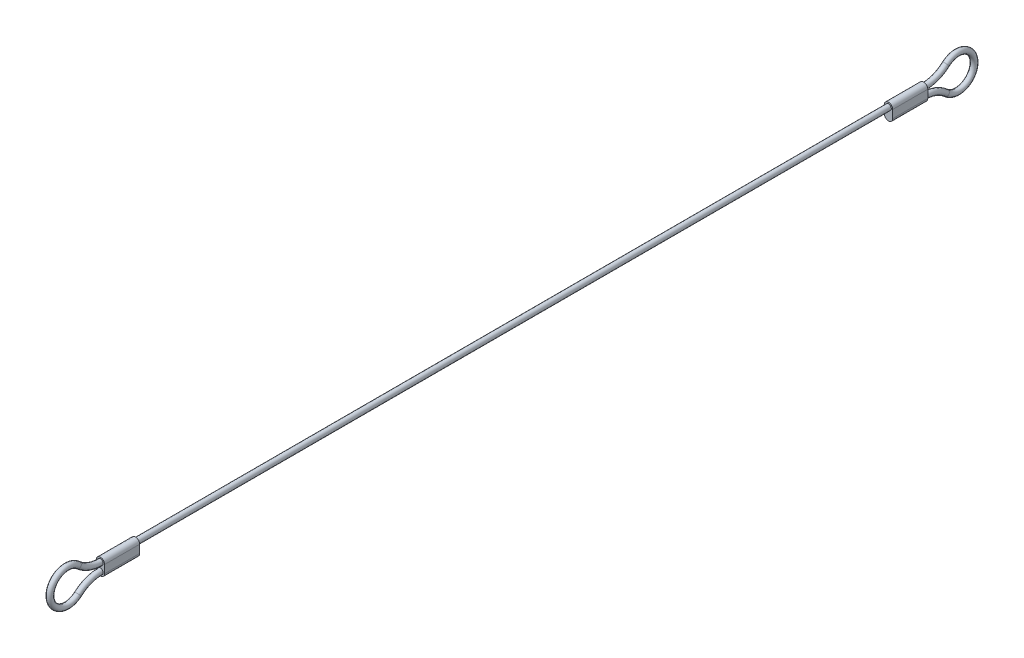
ISO-10303-21;
HEADER;
FILE_DESCRIPTION(('STEP AP214'),'2;1');
FILE_NAME('part.step','',(''),(''),'','','');
FILE_SCHEMA(('AUTOMOTIVE_DESIGN { 1 0 10303 214 1 1 1 1 }'));
ENDSEC;
DATA;
#1=APPLICATION_CONTEXT('core data for automotive mechanical design processes');
#2=APPLICATION_PROTOCOL_DEFINITION('international standard','automotive_design',2000,#1);
#3=PRODUCT_CONTEXT('',#1,'mechanical');
#4=PRODUCT('Part','Part','',(#3));
#5=PRODUCT_RELATED_PRODUCT_CATEGORY('part','',(#4));
#6=PRODUCT_DEFINITION_FORMATION('','',#4);
#7=PRODUCT_DEFINITION_CONTEXT('part definition',#1,'design');
#8=PRODUCT_DEFINITION('design','',#6,#7);
#9=PRODUCT_DEFINITION_SHAPE('','',#8);
#10=(LENGTH_UNIT() NAMED_UNIT(*) SI_UNIT(.MILLI.,.METRE.));
#11=(NAMED_UNIT(*) PLANE_ANGLE_UNIT() SI_UNIT($,.RADIAN.));
#12=(NAMED_UNIT(*) SI_UNIT($,.STERADIAN.) SOLID_ANGLE_UNIT());
#13=UNCERTAINTY_MEASURE_WITH_UNIT(LENGTH_MEASURE(1.E-05),#10,'distance_accuracy_value','');
#14=(GEOMETRIC_REPRESENTATION_CONTEXT(3) GLOBAL_UNCERTAINTY_ASSIGNED_CONTEXT((#13)) GLOBAL_UNIT_ASSIGNED_CONTEXT((#10,
#11,#12)) REPRESENTATION_CONTEXT('',''));
#15=CARTESIAN_POINT('',(0.,0.,0.));
#16=DIRECTION('',(0.,0.,1.));
#17=DIRECTION('',(1.,0.,0.));
#18=AXIS2_PLACEMENT_3D('',#15,#16,#17);
#19=CARTESIAN_POINT('',(0.,0.,-117.4));
#20=DIRECTION('',(0.,0.,1.));
#21=DIRECTION('',(1.,0.,0.));
#22=AXIS2_PLACEMENT_3D('',#19,#20,#21);
#23=CYLINDRICAL_SURFACE('',#22,0.795);
#24=CARTESIAN_POINT('',(0.,0.,-107.4));
#25=DIRECTION('',(0.,0.,1.));
#26=DIRECTION('',(0.,-1.,0.));
#27=AXIS2_PLACEMENT_3D('',#24,#25,#26);
#28=CIRCLE('',#27,0.795);
#29=CARTESIAN_POINT('',(0.,-0.795,-107.4));
#30=VERTEX_POINT('',#29);
#31=EDGE_CURVE('E11',#30,#30,#28,.F.);
#32=ORIENTED_EDGE('',*,*,#31,.F.);
#33=EDGE_LOOP('',(#32));
#34=FACE_BOUND('',#33,.T.);
#35=CARTESIAN_POINT('',(0.,0.,107.4));
#36=DIRECTION('',(0.,0.,-1.));
#37=DIRECTION('',(0.,1.,0.));
#38=AXIS2_PLACEMENT_3D('',#35,#36,#37);
#39=CIRCLE('',#38,0.795);
#40=CARTESIAN_POINT('',(0.,0.795,107.4));
#41=VERTEX_POINT('',#40);
#42=EDGE_CURVE('E51',#41,#41,#39,.F.);
#43=ORIENTED_EDGE('',*,*,#42,.F.);
#44=EDGE_LOOP('',(#43));
#45=FACE_BOUND('',#44,.T.);
#46=ADVANCED_FACE('F41',(#34,#45),#23,.T.);
#47=CARTESIAN_POINT('',(0.,0.,117.4));
#48=DIRECTION('',(0.,0.,-1.));
#49=DIRECTION('',(0.,1.,0.));
#50=AXIS2_PLACEMENT_3D('',#47,#48,#49);
#51=PLANE('',#50);
#52=CARTESIAN_POINT('',(0.,0.,117.4));
#53=DIRECTION('',(0.,0.,-1.));
#54=DIRECTION('',(0.,1.,0.));
#55=AXIS2_PLACEMENT_3D('',#52,#53,#54);
#56=CIRCLE('',#55,1.2);
#57=CARTESIAN_POINT('',(-1.2,0.,117.4));
#58=VERTEX_POINT('',#57);
#59=CARTESIAN_POINT('',(1.2,0.,117.4));
#60=VERTEX_POINT('',#59);
#61=EDGE_CURVE('E185',#58,#60,#56,.T.);
#62=ORIENTED_EDGE('',*,*,#61,.F.);
#63=DIRECTION('',(0.,1.,0.));
#64=VECTOR('',#63,1.);
#65=CARTESIAN_POINT('',(-1.2,0.,117.4));
#66=LINE('',#65,#64);
#67=CARTESIAN_POINT('',(-1.2,-2.26625258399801,117.4));
#68=VERTEX_POINT('',#67);
#69=EDGE_CURVE('E83',#68,#58,#66,.T.);
#70=ORIENTED_EDGE('',*,*,#69,.F.);
#71=CARTESIAN_POINT('',(0.,-2.26625258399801,117.4));
#72=DIRECTION('',(0.,0.,-1.));
#73=DIRECTION('',(0.,1.,0.));
#74=AXIS2_PLACEMENT_3D('',#71,#72,#73);
#75=CIRCLE('',#74,1.2);
#76=CARTESIAN_POINT('',(1.2,-2.26625258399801,117.4));
#77=VERTEX_POINT('',#76);
#78=EDGE_CURVE('E77',#77,#68,#75,.T.);
#79=ORIENTED_EDGE('',*,*,#78,.F.);
#80=DIRECTION('',(0.,-1.,0.));
#81=VECTOR('',#80,1.);
#82=CARTESIAN_POINT('',(1.2,0.,117.4));
#83=LINE('',#82,#81);
#84=EDGE_CURVE('E189',#60,#77,#83,.T.);
#85=ORIENTED_EDGE('',*,*,#84,.F.);
#86=EDGE_LOOP('',(#62,#70,#79,#85));
#87=FACE_BOUND('',#86,.T.);
#88=CARTESIAN_POINT('',(0.,0.,117.4));
#89=DIRECTION('',(0.,0.,-1.));
#90=DIRECTION('',(0.,1.,0.));
#91=AXIS2_PLACEMENT_3D('',#88,#89,#90);
#92=CIRCLE('',#91,0.795);
#93=CARTESIAN_POINT('',(0.,-0.795000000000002,117.4));
#94=VERTEX_POINT('',#93);
#95=EDGE_CURVE('E206',#94,#94,#92,.F.);
#96=ORIENTED_EDGE('',*,*,#95,.F.);
#97=EDGE_LOOP('',(#96));
#98=FACE_BOUND('',#97,.T.);
#99=CARTESIAN_POINT('',(0.,-2.26625258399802,117.4));
#100=DIRECTION('',(0.,0.,-1.));
#101=DIRECTION('',(1.,0.,0.));
#102=AXIS2_PLACEMENT_3D('',#99,#100,#101);
#103=CIRCLE('',#102,0.795);
#104=CARTESIAN_POINT('',(0.,-1.47125258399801,117.4));
#105=VERTEX_POINT('',#104);
#106=EDGE_CURVE('E233',#105,#105,#103,.T.);
#107=ORIENTED_EDGE('',*,*,#106,.T.);
#108=EDGE_LOOP('',(#107));
#109=FACE_BOUND('',#108,.T.);
#110=ADVANCED_FACE('F243',(#87,#98,#109),#51,.F.);
#111=CARTESIAN_POINT('',(0.,0.,107.4));
#112=DIRECTION('',(0.,0.,1.));
#113=DIRECTION('',(0.,-1.,0.));
#114=AXIS2_PLACEMENT_3D('',#111,#112,#113);
#115=CYLINDRICAL_SURFACE('',#114,1.2);
#116=ORIENTED_EDGE('',*,*,#61,.T.);
#117=DIRECTION('',(0.,0.,1.));
#118=VECTOR('',#117,1.);
#119=CARTESIAN_POINT('',(1.2,0.,107.4));
#120=LINE('',#119,#118);
#121=CARTESIAN_POINT('',(1.2,0.,107.4));
#122=VERTEX_POINT('',#121);
#123=EDGE_CURVE('E203',#122,#60,#120,.T.);
#124=ORIENTED_EDGE('',*,*,#123,.F.);
#125=CARTESIAN_POINT('',(0.,0.,107.4));
#126=DIRECTION('',(0.,0.,-1.));
#127=DIRECTION('',(0.,1.,0.));
#128=AXIS2_PLACEMENT_3D('',#125,#126,#127);
#129=CIRCLE('',#128,1.2);
#130=CARTESIAN_POINT('',(-1.2,0.,107.4));
#131=VERTEX_POINT('',#130);
#132=EDGE_CURVE('E175',#131,#122,#129,.T.);
#133=ORIENTED_EDGE('',*,*,#132,.F.);
#134=DIRECTION('',(0.,0.,1.));
#135=VECTOR('',#134,1.);
#136=CARTESIAN_POINT('',(-1.2,0.,107.4));
#137=LINE('',#136,#135);
#138=EDGE_CURVE('E184',#131,#58,#137,.T.);
#139=ORIENTED_EDGE('',*,*,#138,.T.);
#140=EDGE_LOOP('',(#116,#124,#133,#139));
#141=FACE_BOUND('',#140,.T.);
#142=ADVANCED_FACE('F249',(#141),#115,.T.);
#143=CARTESIAN_POINT('',(1.2,0.,107.4));
#144=DIRECTION('',(-1.,0.,0.));
#145=DIRECTION('',(0.,-1.,0.));
#146=AXIS2_PLACEMENT_3D('',#143,#144,#145);
#147=PLANE('',#146);
#148=ORIENTED_EDGE('',*,*,#84,.T.);
#149=DIRECTION('',(0.,0.,1.));
#150=VECTOR('',#149,1.);
#151=CARTESIAN_POINT('',(1.2,-2.26625258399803,107.4));
#152=LINE('',#151,#150);
#153=CARTESIAN_POINT('',(1.2,-2.26625258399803,107.4));
#154=VERTEX_POINT('',#153);
#155=EDGE_CURVE('E200',#154,#77,#152,.T.);
#156=ORIENTED_EDGE('',*,*,#155,.F.);
#157=DIRECTION('',(0.,-1.,0.));
#158=VECTOR('',#157,1.);
#159=CARTESIAN_POINT('',(1.2,0.,107.4));
#160=LINE('',#159,#158);
#161=EDGE_CURVE('E91',#122,#154,#160,.T.);
#162=ORIENTED_EDGE('',*,*,#161,.F.);
#163=ORIENTED_EDGE('',*,*,#123,.T.);
#164=EDGE_LOOP('',(#148,#156,#162,#163));
#165=FACE_BOUND('',#164,.T.);
#166=ADVANCED_FACE('F291',(#165),#147,.F.);
#167=CARTESIAN_POINT('',(0.,-2.26625258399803,107.4));
#168=DIRECTION('',(0.,0.,1.));
#169=DIRECTION('',(0.,-1.,0.));
#170=AXIS2_PLACEMENT_3D('',#167,#168,#169);
#171=CYLINDRICAL_SURFACE('',#170,1.2);
#172=ORIENTED_EDGE('',*,*,#78,.T.);
#173=DIRECTION('',(0.,0.,1.));
#174=VECTOR('',#173,1.);
#175=CARTESIAN_POINT('',(-1.2,-2.26625258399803,107.4));
#176=LINE('',#175,#174);
#177=CARTESIAN_POINT('',(-1.2,-2.26625258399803,107.4));
#178=VERTEX_POINT('',#177);
#179=EDGE_CURVE('E197',#178,#68,#176,.T.);
#180=ORIENTED_EDGE('',*,*,#179,.F.);
#181=CARTESIAN_POINT('',(0.,-2.26625258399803,107.4));
#182=DIRECTION('',(0.,0.,-1.));
#183=DIRECTION('',(0.,1.,0.));
#184=AXIS2_PLACEMENT_3D('',#181,#182,#183);
#185=CIRCLE('',#184,1.2);
#186=EDGE_CURVE('E180',#154,#178,#185,.T.);
#187=ORIENTED_EDGE('',*,*,#186,.F.);
#188=ORIENTED_EDGE('',*,*,#155,.T.);
#189=EDGE_LOOP('',(#172,#180,#187,#188));
#190=FACE_BOUND('',#189,.T.);
#191=ADVANCED_FACE('F284',(#190),#171,.T.);
#192=CARTESIAN_POINT('',(-1.2,0.,107.4));
#193=DIRECTION('',(1.,0.,0.));
#194=DIRECTION('',(0.,0.,-1.));
#195=AXIS2_PLACEMENT_3D('',#192,#193,#194);
#196=PLANE('',#195);
#197=ORIENTED_EDGE('',*,*,#69,.T.);
#198=ORIENTED_EDGE('',*,*,#138,.F.);
#199=DIRECTION('',(0.,1.,0.));
#200=VECTOR('',#199,1.);
#201=CARTESIAN_POINT('',(-1.2,0.,107.4));
#202=LINE('',#201,#200);
#203=EDGE_CURVE('E59',#178,#131,#202,.T.);
#204=ORIENTED_EDGE('',*,*,#203,.F.);
#205=ORIENTED_EDGE('',*,*,#179,.T.);
#206=EDGE_LOOP('',(#197,#198,#204,#205));
#207=FACE_BOUND('',#206,.T.);
#208=ADVANCED_FACE('F279',(#207),#196,.F.);
#209=CARTESIAN_POINT('',(0.,0.,107.4));
#210=DIRECTION('',(0.,0.,-1.));
#211=DIRECTION('',(0.,1.,0.));
#212=AXIS2_PLACEMENT_3D('',#209,#210,#211);
#213=PLANE('',#212);
#214=ORIENTED_EDGE('',*,*,#42,.T.);
#215=EDGE_LOOP('',(#214));
#216=FACE_BOUND('',#215,.T.);
#217=ORIENTED_EDGE('',*,*,#132,.T.);
#218=ORIENTED_EDGE('',*,*,#161,.T.);
#219=ORIENTED_EDGE('',*,*,#186,.T.);
#220=ORIENTED_EDGE('',*,*,#203,.T.);
#221=EDGE_LOOP('',(#217,#218,#219,#220));
#222=FACE_BOUND('',#221,.T.);
#223=ADVANCED_FACE('F240',(#216,#222),#213,.T.);
#224=CARTESIAN_POINT('',(0.,-11.866252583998,117.4));
#225=DIRECTION('',(-1.,0.,0.));
#226=DIRECTION('',(0.,0.,1.));
#227=AXIS2_PLACEMENT_3D('',#224,#225,#226);
#228=TOROIDAL_SURFACE('',#227,9.59999999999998,0.795);
#229=CARTESIAN_POINT('',(0.,-4.71083505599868,123.8));
#230=DIRECTION('',(0.,0.666666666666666,-0.74535599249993));
#231=DIRECTION('',(1.,0.,0.));
#232=AXIS2_PLACEMENT_3D('',#229,#230,#231);
#233=CIRCLE('',#232,0.795);
#234=CARTESIAN_POINT('',(0.,-4.11827704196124,124.33));
#235=VERTEX_POINT('',#234);
#236=EDGE_CURVE('E229',#235,#235,#233,.T.);
#237=CARTESIAN_POINT('',(0.,-11.866252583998,117.4));
#238=DIRECTION('',(-1.,0.,0.));
#239=DIRECTION('',(0.,0.,1.));
#240=AXIS2_PLACEMENT_3D('',#237,#238,#239);
#241=CIRCLE('',#240,10.395);
#242=EDGE_CURVE('',#235,#105,#241,.T.);
#243=ORIENTED_EDGE('',*,*,#236,.T.);
#244=ORIENTED_EDGE('',*,*,#106,.F.);
#245=ORIENTED_EDGE('',*,*,#242,.T.);
#246=ORIENTED_EDGE('',*,*,#242,.F.);
#247=EDGE_LOOP('',(#243,#245,#244,#246));
#248=FACE_BOUND('',#247,.T.);
#249=ADVANCED_FACE('F43',(#248),#228,.T.);
#250=CARTESIAN_POINT('',(0.,-1.13312629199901,127.));
#251=DIRECTION('',(1.,0.,0.));
#252=DIRECTION('',(0.,0.,-1.));
#253=AXIS2_PLACEMENT_3D('',#250,#251,#252);
#254=TOROIDAL_SURFACE('',#253,4.80000000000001,0.795);
#255=ORIENTED_EDGE('',*,*,#236,.F.);
#256=EDGE_LOOP('',(#255));
#257=FACE_BOUND('',#256,.T.);
#258=CARTESIAN_POINT('',(0.,2.44458247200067,123.8));
#259=DIRECTION('',(0.,0.666666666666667,0.74535599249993));
#260=DIRECTION('',(1.,0.,0.));
#261=AXIS2_PLACEMENT_3D('',#258,#259,#260);
#262=CIRCLE('',#261,0.795);
#263=CARTESIAN_POINT('',(0.,1.85202445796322,124.33));
#264=VERTEX_POINT('',#263);
#265=EDGE_CURVE('E225',#264,#264,#262,.T.);
#266=ORIENTED_EDGE('',*,*,#265,.T.);
#267=EDGE_LOOP('',(#266));
#268=FACE_BOUND('',#267,.T.);
#269=ADVANCED_FACE('F259',(#257,#268),#254,.T.);
#270=CARTESIAN_POINT('',(0.,9.59999999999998,117.4));
#271=DIRECTION('',(-1.,0.,0.));
#272=DIRECTION('',(0.,0.,1.));
#273=AXIS2_PLACEMENT_3D('',#270,#271,#272);
#274=TOROIDAL_SURFACE('',#273,9.59999999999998,0.795);
#275=CARTESIAN_POINT('',(0.,9.59999999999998,117.4));
#276=DIRECTION('',(-1.,0.,0.));
#277=DIRECTION('',(0.,0.,1.));
#278=AXIS2_PLACEMENT_3D('',#275,#276,#277);
#279=CIRCLE('',#278,10.395);
#280=EDGE_CURVE('',#94,#264,#279,.T.);
#281=ORIENTED_EDGE('',*,*,#95,.T.);
#282=ORIENTED_EDGE('',*,*,#265,.F.);
#283=ORIENTED_EDGE('',*,*,#280,.T.);
#284=ORIENTED_EDGE('',*,*,#280,.F.);
#285=EDGE_LOOP('',(#281,#283,#282,#284));
#286=FACE_BOUND('',#285,.T.);
#287=ADVANCED_FACE('F257',(#286),#274,.T.);
#288=CARTESIAN_POINT('',(0.,0.,-107.4));
#289=DIRECTION('',(0.,0.,-1.));
#290=DIRECTION('',(0.,1.,0.));
#291=AXIS2_PLACEMENT_3D('',#288,#289,#290);
#292=CYLINDRICAL_SURFACE('',#291,1.2);
#293=CARTESIAN_POINT('',(0.,0.,-117.4));
#294=DIRECTION('',(0.,0.,-1.));
#295=DIRECTION('',(0.,1.,0.));
#296=AXIS2_PLACEMENT_3D('',#293,#294,#295);
#297=CIRCLE('',#296,1.2);
#298=CARTESIAN_POINT('',(-1.2,0.,-117.4));
#299=VERTEX_POINT('',#298);
#300=CARTESIAN_POINT('',(1.2,0.,-117.4));
#301=VERTEX_POINT('',#300);
#302=EDGE_CURVE('E124',#299,#301,#297,.T.);
#303=ORIENTED_EDGE('',*,*,#302,.F.);
#304=DIRECTION('',(0.,0.,-1.));
#305=VECTOR('',#304,1.);
#306=CARTESIAN_POINT('',(-1.2,0.,-107.4));
#307=LINE('',#306,#305);
#308=CARTESIAN_POINT('',(-1.2,0.,-107.4));
#309=VERTEX_POINT('',#308);
#310=EDGE_CURVE('E118',#309,#299,#307,.T.);
#311=ORIENTED_EDGE('',*,*,#310,.F.);
#312=CARTESIAN_POINT('',(0.,0.,-107.4));
#313=DIRECTION('',(0.,0.,-1.));
#314=DIRECTION('',(0.,1.,0.));
#315=AXIS2_PLACEMENT_3D('',#312,#313,#314);
#316=CIRCLE('',#315,1.2);
#317=CARTESIAN_POINT('',(1.2,0.,-107.4));
#318=VERTEX_POINT('',#317);
#319=EDGE_CURVE('E121',#309,#318,#316,.T.);
#320=ORIENTED_EDGE('',*,*,#319,.T.);
#321=DIRECTION('',(0.,0.,-1.));
#322=VECTOR('',#321,1.);
#323=CARTESIAN_POINT('',(1.2,0.,-107.4));
#324=LINE('',#323,#322);
#325=EDGE_CURVE('E155',#318,#301,#324,.T.);
#326=ORIENTED_EDGE('',*,*,#325,.T.);
#327=EDGE_LOOP('',(#303,#311,#320,#326));
#328=FACE_BOUND('',#327,.T.);
#329=ADVANCED_FACE('F120',(#328),#292,.T.);
#330=CARTESIAN_POINT('',(-1.2,0.,-107.4));
#331=DIRECTION('',(-1.,0.,0.));
#332=DIRECTION('',(0.,0.,1.));
#333=AXIS2_PLACEMENT_3D('',#330,#331,#332);
#334=PLANE('',#333);
#335=DIRECTION('',(0.,1.,0.));
#336=VECTOR('',#335,1.);
#337=CARTESIAN_POINT('',(-1.2,0.,-117.4));
#338=LINE('',#337,#336);
#339=CARTESIAN_POINT('',(-1.2,-2.26625258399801,-117.4));
#340=VERTEX_POINT('',#339);
#341=EDGE_CURVE('E158',#340,#299,#338,.T.);
#342=ORIENTED_EDGE('',*,*,#341,.F.);
#343=DIRECTION('',(0.,0.,-1.));
#344=VECTOR('',#343,1.);
#345=CARTESIAN_POINT('',(-1.2,-2.26625258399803,-107.4));
#346=LINE('',#345,#344);
#347=CARTESIAN_POINT('',(-1.2,-2.26625258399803,-107.4));
#348=VERTEX_POINT('',#347);
#349=EDGE_CURVE('E131',#348,#340,#346,.T.);
#350=ORIENTED_EDGE('',*,*,#349,.F.);
#351=DIRECTION('',(0.,1.,0.));
#352=VECTOR('',#351,1.);
#353=CARTESIAN_POINT('',(-1.2,0.,-107.4));
#354=LINE('',#353,#352);
#355=EDGE_CURVE('E137',#348,#309,#354,.T.);
#356=ORIENTED_EDGE('',*,*,#355,.T.);
#357=ORIENTED_EDGE('',*,*,#310,.T.);
#358=EDGE_LOOP('',(#342,#350,#356,#357));
#359=FACE_BOUND('',#358,.T.);
#360=ADVANCED_FACE('F144',(#359),#334,.T.);
#361=CARTESIAN_POINT('',(0.,-2.26625258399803,-107.4));
#362=DIRECTION('',(0.,0.,-1.));
#363=DIRECTION('',(0.,1.,0.));
#364=AXIS2_PLACEMENT_3D('',#361,#362,#363);
#365=CYLINDRICAL_SURFACE('',#364,1.2);
#366=CARTESIAN_POINT('',(0.,-2.26625258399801,-117.4));
#367=DIRECTION('',(0.,0.,-1.));
#368=DIRECTION('',(0.,1.,0.));
#369=AXIS2_PLACEMENT_3D('',#366,#367,#368);
#370=CIRCLE('',#369,1.2);
#371=CARTESIAN_POINT('',(1.2,-2.26625258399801,-117.4));
#372=VERTEX_POINT('',#371);
#373=EDGE_CURVE('E161',#372,#340,#370,.T.);
#374=ORIENTED_EDGE('',*,*,#373,.F.);
#375=DIRECTION('',(0.,0.,-1.));
#376=VECTOR('',#375,1.);
#377=CARTESIAN_POINT('',(1.2,-2.26625258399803,-107.4));
#378=LINE('',#377,#376);
#379=CARTESIAN_POINT('',(1.2,-2.26625258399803,-107.4));
#380=VERTEX_POINT('',#379);
#381=EDGE_CURVE('E170',#380,#372,#378,.T.);
#382=ORIENTED_EDGE('',*,*,#381,.F.);
#383=CARTESIAN_POINT('',(0.,-2.26625258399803,-107.4));
#384=DIRECTION('',(0.,0.,-1.));
#385=DIRECTION('',(0.,1.,0.));
#386=AXIS2_PLACEMENT_3D('',#383,#384,#385);
#387=CIRCLE('',#386,1.2);
#388=EDGE_CURVE('E146',#380,#348,#387,.T.);
#389=ORIENTED_EDGE('',*,*,#388,.T.);
#390=ORIENTED_EDGE('',*,*,#349,.T.);
#391=EDGE_LOOP('',(#374,#382,#389,#390));
#392=FACE_BOUND('',#391,.T.);
#393=ADVANCED_FACE('F324',(#392),#365,.T.);
#394=CARTESIAN_POINT('',(1.2,0.,-107.4));
#395=DIRECTION('',(1.,0.,0.));
#396=DIRECTION('',(0.,1.,0.));
#397=AXIS2_PLACEMENT_3D('',#394,#395,#396);
#398=PLANE('',#397);
#399=DIRECTION('',(0.,-1.,0.));
#400=VECTOR('',#399,1.);
#401=CARTESIAN_POINT('',(1.2,0.,-117.4));
#402=LINE('',#401,#400);
#403=EDGE_CURVE('E142',#301,#372,#402,.T.);
#404=ORIENTED_EDGE('',*,*,#403,.F.);
#405=ORIENTED_EDGE('',*,*,#325,.F.);
#406=DIRECTION('',(0.,-1.,0.));
#407=VECTOR('',#406,1.);
#408=CARTESIAN_POINT('',(1.2,0.,-107.4));
#409=LINE('',#408,#407);
#410=EDGE_CURVE('E140',#318,#380,#409,.T.);
#411=ORIENTED_EDGE('',*,*,#410,.T.);
#412=ORIENTED_EDGE('',*,*,#381,.T.);
#413=EDGE_LOOP('',(#404,#405,#411,#412));
#414=FACE_BOUND('',#413,.T.);
#415=ADVANCED_FACE('F321',(#414),#398,.T.);
#416=CARTESIAN_POINT('',(0.,0.,-107.4));
#417=DIRECTION('',(0.,0.,1.));
#418=DIRECTION('',(0.,1.,0.));
#419=AXIS2_PLACEMENT_3D('',#416,#417,#418);
#420=PLANE('',#419);
#421=ORIENTED_EDGE('',*,*,#31,.T.);
#422=EDGE_LOOP('',(#421));
#423=FACE_BOUND('',#422,.T.);
#424=ORIENTED_EDGE('',*,*,#319,.F.);
#425=ORIENTED_EDGE('',*,*,#355,.F.);
#426=ORIENTED_EDGE('',*,*,#388,.F.);
#427=ORIENTED_EDGE('',*,*,#410,.F.);
#428=EDGE_LOOP('',(#424,#425,#426,#427));
#429=FACE_BOUND('',#428,.T.);
#430=ADVANCED_FACE('F135',(#423,#429),#420,.T.);
#431=CARTESIAN_POINT('',(0.,0.,-117.4));
#432=DIRECTION('',(0.,0.,1.));
#433=DIRECTION('',(0.,1.,0.));
#434=AXIS2_PLACEMENT_3D('',#431,#432,#433);
#435=PLANE('',#434);
#436=CARTESIAN_POINT('',(0.,-2.26625258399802,-117.4));
#437=DIRECTION('',(0.,0.,-1.));
#438=DIRECTION('',(1.,0.,0.));
#439=AXIS2_PLACEMENT_3D('',#436,#437,#438);
#440=CIRCLE('',#439,0.795);
#441=CARTESIAN_POINT('',(0.,-1.47125258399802,-117.4));
#442=VERTEX_POINT('',#441);
#443=EDGE_CURVE('E130',#442,#442,#440,.T.);
#444=ORIENTED_EDGE('',*,*,#443,.F.);
#445=EDGE_LOOP('',(#444));
#446=FACE_BOUND('',#445,.T.);
#447=CARTESIAN_POINT('',(0.,0.,-117.4));
#448=DIRECTION('',(0.,0.,1.));
#449=DIRECTION('',(1.,0.,0.));
#450=AXIS2_PLACEMENT_3D('',#447,#448,#449);
#451=CIRCLE('',#450,0.795);
#452=CARTESIAN_POINT('',(0.,-0.795000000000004,-117.4));
#453=VERTEX_POINT('',#452);
#454=EDGE_CURVE('E221',#453,#453,#451,.T.);
#455=ORIENTED_EDGE('',*,*,#454,.T.);
#456=EDGE_LOOP('',(#455));
#457=FACE_BOUND('',#456,.T.);
#458=ORIENTED_EDGE('',*,*,#302,.T.);
#459=ORIENTED_EDGE('',*,*,#403,.T.);
#460=ORIENTED_EDGE('',*,*,#373,.T.);
#461=ORIENTED_EDGE('',*,*,#341,.T.);
#462=EDGE_LOOP('',(#458,#459,#460,#461));
#463=FACE_BOUND('',#462,.T.);
#464=ADVANCED_FACE('F300',(#446,#457,#463),#435,.F.);
#465=CARTESIAN_POINT('',(0.,-11.866252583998,-117.4));
#466=DIRECTION('',(-1.,0.,0.));
#467=DIRECTION('',(0.,0.,1.));
#468=AXIS2_PLACEMENT_3D('',#465,#466,#467);
#469=TOROIDAL_SURFACE('',#468,9.59999999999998,0.795);
#470=CARTESIAN_POINT('',(0.,-4.71083505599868,-123.8));
#471=DIRECTION('',(0.,-0.666666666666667,-0.74535599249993));
#472=DIRECTION('',(1.,0.,0.));
#473=AXIS2_PLACEMENT_3D('',#470,#471,#472);
#474=CIRCLE('',#473,0.795);
#475=CARTESIAN_POINT('',(0.,-4.11827704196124,-124.33));
#476=VERTEX_POINT('',#475);
#477=EDGE_CURVE('E210',#476,#476,#474,.T.);
#478=CARTESIAN_POINT('',(0.,-11.866252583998,-117.4));
#479=DIRECTION('',(-1.,0.,0.));
#480=DIRECTION('',(0.,0.,1.));
#481=AXIS2_PLACEMENT_3D('',#478,#479,#480);
#482=CIRCLE('',#481,10.395);
#483=EDGE_CURVE('',#442,#476,#482,.T.);
#484=ORIENTED_EDGE('',*,*,#443,.T.);
#485=ORIENTED_EDGE('',*,*,#477,.F.);
#486=ORIENTED_EDGE('',*,*,#483,.T.);
#487=ORIENTED_EDGE('',*,*,#483,.F.);
#488=EDGE_LOOP('',(#484,#486,#485,#487));
#489=FACE_BOUND('',#488,.T.);
#490=ADVANCED_FACE('F297',(#489),#469,.T.);
#491=CARTESIAN_POINT('',(0.,-1.13312629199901,-127.));
#492=DIRECTION('',(1.,0.,0.));
#493=DIRECTION('',(0.,0.,-1.));
#494=AXIS2_PLACEMENT_3D('',#491,#492,#493);
#495=TOROIDAL_SURFACE('',#494,4.80000000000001,0.795);
#496=CARTESIAN_POINT('',(0.,2.44458247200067,-123.8));
#497=DIRECTION('',(0.,-0.666666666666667,0.74535599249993));
#498=DIRECTION('',(1.,0.,0.));
#499=AXIS2_PLACEMENT_3D('',#496,#497,#498);
#500=CIRCLE('',#499,0.795);
#501=CARTESIAN_POINT('',(0.,1.85202445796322,-124.33));
#502=VERTEX_POINT('',#501);
#503=EDGE_CURVE('E217',#502,#502,#500,.T.);
#504=ORIENTED_EDGE('',*,*,#503,.F.);
#505=EDGE_LOOP('',(#504));
#506=FACE_BOUND('',#505,.T.);
#507=ORIENTED_EDGE('',*,*,#477,.T.);
#508=EDGE_LOOP('',(#507));
#509=FACE_BOUND('',#508,.T.);
#510=ADVANCED_FACE('F299',(#506,#509),#495,.T.);
#511=CARTESIAN_POINT('',(0.,9.59999999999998,-117.4));
#512=DIRECTION('',(-1.,0.,0.));
#513=DIRECTION('',(0.,0.,1.));
#514=AXIS2_PLACEMENT_3D('',#511,#512,#513);
#515=TOROIDAL_SURFACE('',#514,9.59999999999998,0.795);
#516=CARTESIAN_POINT('',(0.,9.59999999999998,-117.4));
#517=DIRECTION('',(-1.,0.,0.));
#518=DIRECTION('',(0.,0.,1.));
#519=AXIS2_PLACEMENT_3D('',#516,#517,#518);
#520=CIRCLE('',#519,10.395);
#521=EDGE_CURVE('',#502,#453,#520,.T.);
#522=ORIENTED_EDGE('',*,*,#503,.T.);
#523=ORIENTED_EDGE('',*,*,#454,.F.);
#524=ORIENTED_EDGE('',*,*,#521,.T.);
#525=ORIENTED_EDGE('',*,*,#521,.F.);
#526=EDGE_LOOP('',(#522,#524,#523,#525));
#527=FACE_BOUND('',#526,.T.);
#528=ADVANCED_FACE('F255',(#527),#515,.T.);
#529=CLOSED_SHELL('',(#46,#110,#142,#166,#191,#208,#223,#249,#269,#287,#329,#360,#393,#415,#430,
#464,#490,#510,#528));
#530=MANIFOLD_SOLID_BREP('B2',#529);
#531=ADVANCED_BREP_SHAPE_REPRESENTATION('',(#18,#530),#14);
#532=SHAPE_DEFINITION_REPRESENTATION(#9,#531);
ENDSEC;
END-ISO-10303-21;
